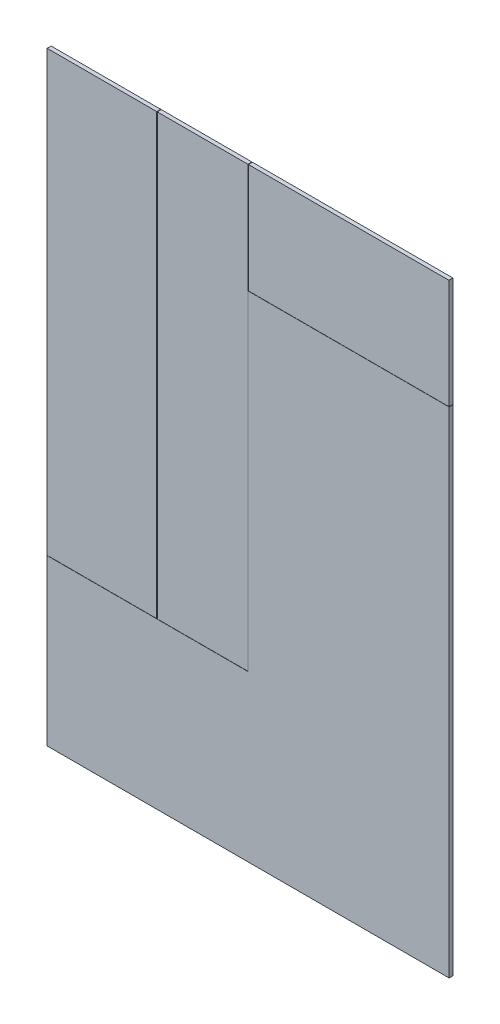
from build123d import *

# Parameters (mm, degrees)
ESBO_O1_W                = 1830
ESBO_O1_H                = 2750
RESSALTO_EXTRUS_O1_DEPTH = 18
ESBO_O2_W                = 414
ESBO_O2_H                = 2000
ESBO_O2_W_2              = 412
ESBO_O2_H_2              = 1998
ESBO_O2_W_3              = 500
ESBO_O2_W_4              = 498
ESBO_O2_W_5              = 914
ESBO_O2_H_3              = 500
ESBO_O2_W_6              = 912
ESBO_O2_H_4              = 498
CORTE_EXTRUS_O1_DEPTH    = 18


with BuildPart() as part:
    # Esbo_o1 → Ressalto-extrus_o1 (new body)
    with BuildSketch(Plane.XY):
        with Locations((-915, 1375)):
            Rectangle(ESBO_O1_W, ESBO_O1_H)
    extrude(amount=RESSALTO_EXTRUS_O1_DEPTH)

    # Esbo_o2 → Corte-extrus_o1 (cut)
    # profile 1 of 3: a face of its own
    with BuildSketch(Plane.XY.offset(18)):
        with Locations((-1122, 1750)):
            Rectangle(ESBO_O2_W, ESBO_O2_H)
        with Locations((-1122, 1750)):
            Rectangle(ESBO_O2_W_2, ESBO_O2_H_2, mode=Mode.SUBTRACT)
    # profile 2 of 3: a face of its own
    with BuildSketch(Plane.XY.offset(18)):
        with Locations((-1580, 1750)):
            Rectangle(ESBO_O2_W_3, ESBO_O2_H)
        with Locations((-1580, 1750)):
            Rectangle(ESBO_O2_W_4, ESBO_O2_H_2, mode=Mode.SUBTRACT)
    # profile 3 of 3: a face of its own
    with BuildSketch(Plane.XY.offset(18)):
        with Locations((-457, 2500)):
            Rectangle(ESBO_O2_W_5, ESBO_O2_H_3)
        with Locations((-457, 2500)):
            Rectangle(ESBO_O2_W_6, ESBO_O2_H_4, mode=Mode.SUBTRACT)
    extrude(amount=-CORTE_EXTRUS_O1_DEPTH, mode=Mode.SUBTRACT)


with BuildPart() as corte_extrus_o1_piece_1:
    # of the separate pieces the step leaves, piece 1, a body of its own (corte_extrus_o1_pieces)
    add(part.part.solids().sort_by_distance((0, 0, 0))[0])


with BuildPart() as corte_extrus_o1_piece_2:
    # of the separate pieces the step leaves, piece 2, a body of its own (corte_extrus_o1_pieces)
    add(part.part.solids().sort_by_distance((-1331, 751, 0))[0])


with BuildPart() as corte_extrus_o1_piece_3:
    # of the separate pieces the step leaves, piece 3, a body of its own (corte_extrus_o1_pieces)
    add(part.part.solids().sort_by_distance((-916, 751, 0))[0])


with BuildPart() as corte_extrus_o1_piece_4:
    # of the separate pieces the step leaves, piece 4, a body of its own (corte_extrus_o1_pieces)
    add(part.part.solids().sort_by_distance((-913, 2749, 0))[0])


solid = Compound([corte_extrus_o1_piece_1.part, corte_extrus_o1_piece_2.part, corte_extrus_o1_piece_3.part, corte_extrus_o1_piece_4.part])
